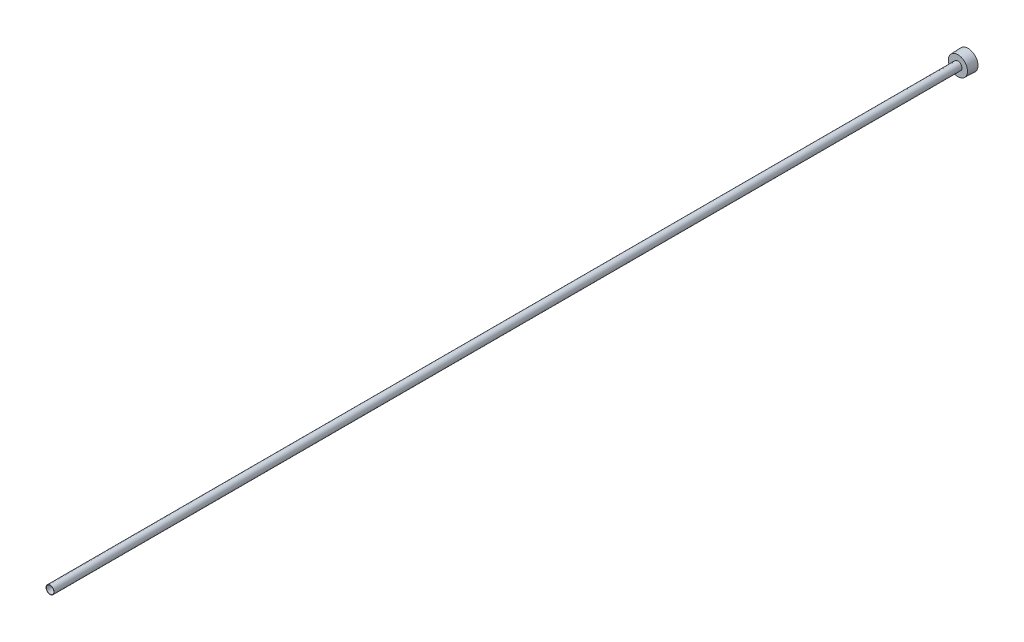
from build123d import *

# Parameters (mm, degrees)
SKETCH2_R          = 5.0419
CUT_EXTRUDE1_DEPTH = 1220.343353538
CUT_EXTRUDE2_DEPTH = 9.525


with BuildPart() as part:
    # Sketch1 → Revolve1 (revolve)
    with BuildSketch(Plane(origin=(0, 0, 0), x_dir=(0, 0, -1), z_dir=(1, 0, 0)), mode=Mode.PRIVATE) as revolve1_sk:
        Polygon((-1219.2, 0), (0, 0), (0, 13.2207), (-13.4874, 12.728732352), (-13.4874, 5.4229), (-1219.2, 5.4229), align=None)
    revolve(revolve1_sk.sketch.rotate(Axis((0, 0, 278.001114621), (0, 0, -1)), 90), axis=Axis((0, 0, 278.001114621), (0, 0, -1)))

    # Sketch2 → Cut-Extrude1 (cut, through all)
    with BuildSketch(Plane.XY.offset(1219.2)):
        Circle(SKETCH2_R)
    extrude(amount=-CUT_EXTRUDE1_DEPTH, mode=Mode.SUBTRACT)

    # Sketch3 → Cut-Extrude2 (cut)
    with BuildSketch(Plane(origin=(0, 0, 0), x_dir=(-1, 0, 0), z_dir=(0, 0, -1))):
        Polygon((0, -10.998522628), (9.525, -5.499261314), (9.525, 5.499261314), (0, 10.998522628), (-9.525, 5.499261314), (-9.525, -5.499261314), align=None)
    extrude(amount=-CUT_EXTRUDE2_DEPTH, mode=Mode.SUBTRACT)


solid = part.part
